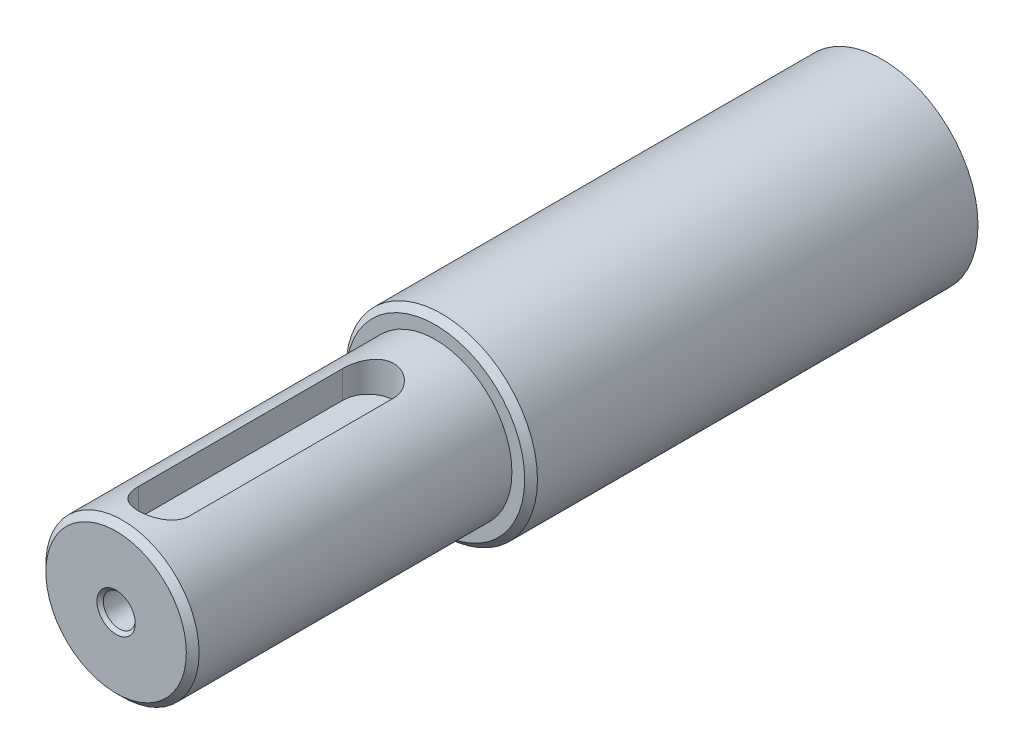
ISO-10303-21;
HEADER;
FILE_DESCRIPTION(('STEP AP214'),'2;1');
FILE_NAME('part.step','',(''),(''),'','','');
FILE_SCHEMA(('AUTOMOTIVE_DESIGN { 1 0 10303 214 1 1 1 1 }'));
ENDSEC;
DATA;
#1=APPLICATION_CONTEXT('core data for automotive mechanical design processes');
#2=APPLICATION_PROTOCOL_DEFINITION('international standard','automotive_design',2000,#1);
#3=PRODUCT_CONTEXT('',#1,'mechanical');
#4=PRODUCT('Part','Part','',(#3));
#5=PRODUCT_RELATED_PRODUCT_CATEGORY('part','',(#4));
#6=PRODUCT_DEFINITION_FORMATION('','',#4);
#7=PRODUCT_DEFINITION_CONTEXT('part definition',#1,'design');
#8=PRODUCT_DEFINITION('design','',#6,#7);
#9=PRODUCT_DEFINITION_SHAPE('','',#8);
#10=(LENGTH_UNIT() NAMED_UNIT(*) SI_UNIT(.MILLI.,.METRE.));
#11=(NAMED_UNIT(*) PLANE_ANGLE_UNIT() SI_UNIT($,.RADIAN.));
#12=(NAMED_UNIT(*) SI_UNIT($,.STERADIAN.) SOLID_ANGLE_UNIT());
#13=UNCERTAINTY_MEASURE_WITH_UNIT(LENGTH_MEASURE(1.E-05),#10,'distance_accuracy_value','');
#14=(GEOMETRIC_REPRESENTATION_CONTEXT(3) GLOBAL_UNCERTAINTY_ASSIGNED_CONTEXT((#13)) GLOBAL_UNIT_ASSIGNED_CONTEXT((#10,
#11,#12)) REPRESENTATION_CONTEXT('',''));
#15=CARTESIAN_POINT('',(0.,0.,0.));
#16=DIRECTION('',(0.,0.,1.));
#17=DIRECTION('',(1.,0.,0.));
#18=AXIS2_PLACEMENT_3D('',#15,#16,#17);
#19=CARTESIAN_POINT('',(0.,0.,120.));
#20=DIRECTION('',(0.,0.,-1.));
#21=DIRECTION('',(-1.,0.,0.));
#22=AXIS2_PLACEMENT_3D('',#19,#20,#21);
#23=CYLINDRICAL_SURFACE('',#22,12.);
#24=CARTESIAN_POINT('',(0.,0.,70.));
#25=DIRECTION('',(0.,0.,1.));
#26=DIRECTION('',(1.,0.,0.));
#27=AXIS2_PLACEMENT_3D('',#24,#25,#26);
#28=CIRCLE('',#27,12.);
#29=CARTESIAN_POINT('',(12.,0.,70.));
#30=VERTEX_POINT('',#29);
#31=EDGE_CURVE('E105',#30,#30,#28,.T.);
#32=ORIENTED_EDGE('',*,*,#31,.T.);
#33=EDGE_LOOP('',(#32));
#34=FACE_BOUND('',#33,.T.);
#35=CARTESIAN_POINT('',(0.,0.,119.));
#36=DIRECTION('',(0.,0.,1.));
#37=DIRECTION('',(1.,0.,0.));
#38=AXIS2_PLACEMENT_3D('',#35,#36,#37);
#39=CIRCLE('',#38,12.);
#40=CARTESIAN_POINT('',(12.,0.,119.));
#41=VERTEX_POINT('',#40);
#42=EDGE_CURVE('E114',#41,#41,#39,.F.);
#43=ORIENTED_EDGE('',*,*,#42,.T.);
#44=EDGE_LOOP('',(#43));
#45=FACE_BOUND('',#44,.T.);
#46=CARTESIAN_POINT('',(0.,12.,108.5));
#47=CARTESIAN_POINT('',(-0.218253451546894,12.0000006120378,108.499998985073));
#48=CARTESIAN_POINT('',(-0.436500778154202,11.9939907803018,108.517921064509));
#49=CARTESIAN_POINT('',(-0.866567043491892,11.9706084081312,108.588916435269));
#50=CARTESIAN_POINT('',(-1.07838531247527,11.9532346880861,108.641993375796));
#51=CARTESIAN_POINT('',(-1.48933115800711,11.9090123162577,108.781276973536));
#52=CARTESIAN_POINT('',(-1.68847930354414,11.8821795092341,108.867428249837));
#53=CARTESIAN_POINT('',(-2.0694997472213,11.8217778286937,109.070164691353));
#54=CARTESIAN_POINT('',(-2.25136862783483,11.7882076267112,109.18675586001));
#55=CARTESIAN_POINT('',(-2.59896670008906,11.7165637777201,109.451303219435));
#56=CARTESIAN_POINT('',(-2.76401480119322,11.6783822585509,109.600124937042));
#57=CARTESIAN_POINT('',(-3.06733077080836,11.6024125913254,109.923068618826));
#58=CARTESIAN_POINT('',(-3.20559274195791,11.5646245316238,110.097196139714));
#59=CARTESIAN_POINT('',(-3.45529976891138,11.4925332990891,110.471940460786));
#60=CARTESIAN_POINT('',(-3.5658594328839,11.4583615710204,110.673174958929));
#61=CARTESIAN_POINT('',(-3.75127549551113,11.3990122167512,111.092704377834));
#62=CARTESIAN_POINT('',(-3.82614278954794,11.3738318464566,111.310994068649));
#63=CARTESIAN_POINT('',(-3.93549384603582,11.3364521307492,111.750692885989));
#64=CARTESIAN_POINT('',(-3.97125379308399,11.3238438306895,111.971748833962));
#65=CARTESIAN_POINT('',(-4.005364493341,11.3118262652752,112.417055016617));
#66=CARTESIAN_POINT('',(-4.0037268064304,11.312412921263,112.641304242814));
#67=CARTESIAN_POINT('',(-3.96407961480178,11.3263605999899,113.075746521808));
#68=CARTESIAN_POINT('',(-3.92773565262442,11.3391366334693,113.286113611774));
#69=CARTESIAN_POINT('',(-3.82242465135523,11.3750663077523,113.697573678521));
#70=CARTESIAN_POINT('',(-3.75345370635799,11.3982211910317,113.898665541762));
#71=CARTESIAN_POINT('',(-3.58375623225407,11.4527164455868,114.289650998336));
#72=CARTESIAN_POINT('',(-3.4825361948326,11.4841826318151,114.47931210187));
#73=CARTESIAN_POINT('',(-3.251556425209,11.5517023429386,114.839483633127));
#74=CARTESIAN_POINT('',(-3.12178844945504,11.5877571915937,115.009988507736));
#75=CARTESIAN_POINT('',(-2.82939733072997,11.6626931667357,115.336366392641));
#76=CARTESIAN_POINT('',(-2.66541260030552,11.7016235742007,115.491010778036));
#77=CARTESIAN_POINT('',(-2.31335827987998,11.7762775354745,115.770925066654));
#78=CARTESIAN_POINT('',(-2.12528638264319,11.8120007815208,115.896192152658));
#79=CARTESIAN_POINT('',(-1.72779045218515,11.8766843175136,116.11478520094));
#80=CARTESIAN_POINT('',(-1.51817310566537,11.9055740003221,116.207781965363));
#81=CARTESIAN_POINT('',(-1.08507633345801,11.9528226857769,116.356812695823));
#82=CARTESIAN_POINT('',(-0.861601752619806,11.971185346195,116.412859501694));
#83=CARTESIAN_POINT('',(-0.417535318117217,11.9947050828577,116.484222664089));
#84=CARTESIAN_POINT('',(-0.197238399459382,12.0004000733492,116.501199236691));
#85=CARTESIAN_POINT('',(0.243100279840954,11.9995561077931,116.498669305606));
#86=CARTESIAN_POINT('',(0.463142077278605,11.9930192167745,116.479168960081));
#87=CARTESIAN_POINT('',(0.890079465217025,11.9688009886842,116.405552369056));
#88=CARTESIAN_POINT('',(1.09717122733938,11.9514479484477,116.352455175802));
#89=CARTESIAN_POINT('',(1.4994238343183,11.9076738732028,116.214426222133));
#90=CARTESIAN_POINT('',(1.69458315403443,11.881251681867,116.129490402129));
#91=CARTESIAN_POINT('',(2.0731531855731,11.8211572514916,115.927718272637));
#92=CARTESIAN_POINT('',(2.25611983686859,11.7873125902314,115.810101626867));
#93=CARTESIAN_POINT('',(2.60025932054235,11.7162101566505,115.547223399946));
#94=CARTESIAN_POINT('',(2.76142547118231,11.6789513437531,115.401953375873));
#95=CARTESIAN_POINT('',(3.0650100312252,11.6030739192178,115.080084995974));
#96=CARTESIAN_POINT('',(3.20624387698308,11.5644704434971,114.902363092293));
#97=CARTESIAN_POINT('',(3.4570300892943,11.4919989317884,114.524913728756));
#98=CARTESIAN_POINT('',(3.56658219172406,11.4581309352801,114.325186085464));
#99=CARTESIAN_POINT('',(3.75038772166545,11.3992956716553,113.90930793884));
#100=CARTESIAN_POINT('',(3.82471252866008,11.3743104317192,113.693191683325));
#101=CARTESIAN_POINT('',(3.93557866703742,11.336433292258,113.250485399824));
#102=CARTESIAN_POINT('',(3.97213701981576,11.3235359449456,113.023900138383));
#103=CARTESIAN_POINT('',(4.00510512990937,11.3119143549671,112.579211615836));
#104=CARTESIAN_POINT('',(4.0034810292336,11.3124960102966,112.361270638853));
#105=CARTESIAN_POINT('',(3.96496917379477,11.3260507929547,111.928939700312));
#106=CARTESIAN_POINT('',(3.92808351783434,11.3390231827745,111.71454952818));
#107=CARTESIAN_POINT('',(3.82148725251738,11.3753809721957,111.29945734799));
#108=CARTESIAN_POINT('',(3.75241338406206,11.3985639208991,111.098572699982));
#109=CARTESIAN_POINT('',(3.58391746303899,11.4526559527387,110.711090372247));
#110=CARTESIAN_POINT('',(3.48448867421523,11.4835667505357,110.524495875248));
#111=CARTESIAN_POINT('',(3.25304277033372,11.5513131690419,110.162065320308));
#112=CARTESIAN_POINT('',(3.11979297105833,11.5883484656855,109.987053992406));
#113=CARTESIAN_POINT('',(2.8265715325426,11.6633342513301,109.661240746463));
#114=CARTESIAN_POINT('',(2.66659233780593,11.7012849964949,109.510445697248));
#115=CARTESIAN_POINT('',(2.31696622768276,11.7756012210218,109.231422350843));
#116=CARTESIAN_POINT('',(2.12640605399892,11.8118472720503,109.104302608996));
#117=CARTESIAN_POINT('',(1.7254294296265,11.8770396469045,108.884038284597));
#118=CARTESIAN_POINT('',(1.51501807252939,11.9059878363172,108.790885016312));
#119=CARTESIAN_POINT('',(1.0899745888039,11.9522206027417,108.645113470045));
#120=CARTESIAN_POINT('',(0.87595103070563,11.9699684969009,108.590870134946));
#121=CARTESIAN_POINT('',(0.441281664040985,11.9938562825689,108.518318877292));
#122=CARTESIAN_POINT('',(0.220637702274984,11.9999993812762,108.500001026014));
#123=CARTESIAN_POINT('',(0.,12.,108.5));
#124=B_SPLINE_CURVE_WITH_KNOTS('',3,(#46,#47,#48,#49,#50,#51,#52,#53,#54,#55,#56,#57,#58,#59,
#60,#61,#62,#63,#64,#65,#66,#67,#68,#69,#70,#71,#72,#73,#74,#75,#76,#77,#78,#79,#80,#81,#82,#83,
#84,#85,#86,#87,#88,#89,#90,#91,#92,#93,#94,#95,#96,#97,#98,#99,#100,#101,#102,#103,#104,#105,
#106,#107,#108,#109,#110,#111,#112,#113,#114,#115,#116,#117,#118,#119,#120,#121,#122,#123),
.UNSPECIFIED.,.T.,.F.,(4,2,2,2,2,2,2,2,2,2,2,2,2,2,2,2,2,2,2,2,2,2,2,2,2,2,2,2,2,2,2,2,2,2,2,2,
2,2,4),(0.,0.653948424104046,1.30796474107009,1.9608906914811,2.6139455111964,3.28738737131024,
3.96097733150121,4.65393539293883,5.34668178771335,6.01607702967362,6.68526535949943,
7.32387306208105,7.96255723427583,8.61152684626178,9.26068410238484,9.94373223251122,
10.6268458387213,11.3167362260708,12.0063867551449,12.6661433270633,13.3257885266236,
13.9663263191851,14.6069458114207,15.264415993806,15.9220872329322,16.6096409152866,
17.2972003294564,17.9833605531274,18.6692113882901,19.3198266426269,19.9704031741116,
20.6086234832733,21.2469855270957,21.9132026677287,22.5796084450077,23.2719864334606,
23.9641872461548,24.6254623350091,25.2865546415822),.UNSPECIFIED.);
#125=CARTESIAN_POINT('',(-4.,11.3137084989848,112.5));
#126=VERTEX_POINT('',#125);
#127=CARTESIAN_POINT('',(4.,11.3137084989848,112.5));
#128=VERTEX_POINT('',#127);
#129=EDGE_CURVE('E55',#126,#128,#124,.T.);
#130=ORIENTED_EDGE('',*,*,#129,.F.);
#131=DIRECTION('',(0.,0.,-1.));
#132=VECTOR('',#131,1.);
#133=CARTESIAN_POINT('',(-4.,11.3137084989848,120.));
#134=LINE('',#133,#132);
#135=CARTESIAN_POINT('',(-4.,11.3137084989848,80.5));
#136=VERTEX_POINT('',#135);
#137=EDGE_CURVE('E123',#136,#126,#134,.F.);
#138=ORIENTED_EDGE('',*,*,#137,.F.);
#139=CARTESIAN_POINT('',(0.,12.,76.5));
#140=CARTESIAN_POINT('',(-0.218253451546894,12.0000006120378,76.4999989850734));
#141=CARTESIAN_POINT('',(-0.436500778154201,11.9939907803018,76.5179210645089));
#142=CARTESIAN_POINT('',(-0.866567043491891,11.9706084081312,76.5889164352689));
#143=CARTESIAN_POINT('',(-1.07838531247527,11.9532346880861,76.6419933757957));
#144=CARTESIAN_POINT('',(-1.4893311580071,11.9090123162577,76.7812769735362));
#145=CARTESIAN_POINT('',(-1.68847930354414,11.8821795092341,76.8674282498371));
#146=CARTESIAN_POINT('',(-2.0694997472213,11.8217778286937,77.0701646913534));
#147=CARTESIAN_POINT('',(-2.25136862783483,11.7882076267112,77.1867558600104));
#148=CARTESIAN_POINT('',(-2.59896670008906,11.7165637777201,77.451303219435));
#149=CARTESIAN_POINT('',(-2.76401480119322,11.6783822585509,77.600124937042));
#150=CARTESIAN_POINT('',(-3.06733077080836,11.6024125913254,77.9230686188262));
#151=CARTESIAN_POINT('',(-3.20559274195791,11.5646245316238,78.0971961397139));
#152=CARTESIAN_POINT('',(-3.45529976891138,11.4925332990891,78.471940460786));
#153=CARTESIAN_POINT('',(-3.5658594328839,11.4583615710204,78.673174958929));
#154=CARTESIAN_POINT('',(-3.75127549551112,11.3990122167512,79.0927043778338));
#155=CARTESIAN_POINT('',(-3.82614278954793,11.3738318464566,79.3109940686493));
#156=CARTESIAN_POINT('',(-3.93549384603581,11.3364521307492,79.7506928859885));
#157=CARTESIAN_POINT('',(-3.97125379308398,11.3238438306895,79.9717488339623));
#158=CARTESIAN_POINT('',(-4.005364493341,11.3118262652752,80.4170550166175));
#159=CARTESIAN_POINT('',(-4.0037268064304,11.312412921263,80.6413042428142));
#160=CARTESIAN_POINT('',(-3.96407961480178,11.3263605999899,81.0757465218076));
#161=CARTESIAN_POINT('',(-3.92773565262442,11.3391366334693,81.2861136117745));
#162=CARTESIAN_POINT('',(-3.82242465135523,11.3750663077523,81.6975736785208));
#163=CARTESIAN_POINT('',(-3.75345370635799,11.3982211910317,81.898665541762));
#164=CARTESIAN_POINT('',(-3.58375623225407,11.4527164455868,82.2896509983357));
#165=CARTESIAN_POINT('',(-3.4825361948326,11.4841826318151,82.47931210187));
#166=CARTESIAN_POINT('',(-3.25155642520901,11.5517023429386,82.839483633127));
#167=CARTESIAN_POINT('',(-3.12178844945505,11.5877571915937,83.0099885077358));
#168=CARTESIAN_POINT('',(-2.82939733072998,11.6626931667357,83.3363663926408));
#169=CARTESIAN_POINT('',(-2.66541260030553,11.7016235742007,83.4910107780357));
#170=CARTESIAN_POINT('',(-2.31335827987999,11.7762775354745,83.7709250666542));
#171=CARTESIAN_POINT('',(-2.12528638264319,11.8120007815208,83.8961921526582));
#172=CARTESIAN_POINT('',(-1.72779045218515,11.8766843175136,84.1147852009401));
#173=CARTESIAN_POINT('',(-1.51817310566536,11.9055740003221,84.2077819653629));
#174=CARTESIAN_POINT('',(-1.08507633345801,11.9528226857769,84.3568126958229));
#175=CARTESIAN_POINT('',(-0.861601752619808,11.971185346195,84.4128595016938));
#176=CARTESIAN_POINT('',(-0.417535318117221,11.9947050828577,84.4842226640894));
#177=CARTESIAN_POINT('',(-0.197238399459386,12.0004000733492,84.501199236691));
#178=CARTESIAN_POINT('',(0.243100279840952,11.9995561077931,84.4986693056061));
#179=CARTESIAN_POINT('',(0.463142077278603,11.9930192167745,84.4791689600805));
#180=CARTESIAN_POINT('',(0.890079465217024,11.9688009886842,84.4055523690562));
#181=CARTESIAN_POINT('',(1.09717122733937,11.9514479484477,84.352455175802));
#182=CARTESIAN_POINT('',(1.4994238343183,11.9076738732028,84.2144262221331));
#183=CARTESIAN_POINT('',(1.69458315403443,11.881251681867,84.1294904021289));
#184=CARTESIAN_POINT('',(2.0731531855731,11.8211572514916,83.9277182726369));
#185=CARTESIAN_POINT('',(2.25611983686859,11.7873125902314,83.8101016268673));
#186=CARTESIAN_POINT('',(2.60025932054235,11.7162101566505,83.5472233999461));
#187=CARTESIAN_POINT('',(2.76142547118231,11.6789513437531,83.4019533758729));
#188=CARTESIAN_POINT('',(3.0650100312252,11.6030739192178,83.0800849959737));
#189=CARTESIAN_POINT('',(3.20624387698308,11.5644704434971,82.9023630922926));
#190=CARTESIAN_POINT('',(3.4570300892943,11.4919989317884,82.5249137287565));
#191=CARTESIAN_POINT('',(3.56658219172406,11.4581309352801,82.3251860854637));
#192=CARTESIAN_POINT('',(3.75038772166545,11.3992956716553,81.9093079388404));
#193=CARTESIAN_POINT('',(3.82471252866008,11.3743104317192,81.693191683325));
#194=CARTESIAN_POINT('',(3.93557866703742,11.336433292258,81.2504853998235));
#195=CARTESIAN_POINT('',(3.97213701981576,11.3235359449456,81.0239001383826));
#196=CARTESIAN_POINT('',(4.00510512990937,11.3119143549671,80.5792116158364));
#197=CARTESIAN_POINT('',(4.0034810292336,11.3124960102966,80.3612706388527));
#198=CARTESIAN_POINT('',(3.96496917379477,11.3260507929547,79.9289397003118));
#199=CARTESIAN_POINT('',(3.92808351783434,11.3390231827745,79.7145495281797));
#200=CARTESIAN_POINT('',(3.82148725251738,11.3753809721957,79.2994573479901));
#201=CARTESIAN_POINT('',(3.75241338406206,11.3985639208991,79.098572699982));
#202=CARTESIAN_POINT('',(3.58391746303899,11.4526559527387,78.7110903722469));
#203=CARTESIAN_POINT('',(3.48448867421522,11.4835667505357,78.524495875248));
#204=CARTESIAN_POINT('',(3.25304277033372,11.5513131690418,78.1620653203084));
#205=CARTESIAN_POINT('',(3.11979297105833,11.5883484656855,77.9870539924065));
#206=CARTESIAN_POINT('',(2.8265715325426,11.6633342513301,77.6612407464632));
#207=CARTESIAN_POINT('',(2.66659233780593,11.7012849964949,77.5104456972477));
#208=CARTESIAN_POINT('',(2.31696622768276,11.7756012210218,77.2314223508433));
#209=CARTESIAN_POINT('',(2.12640605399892,11.8118472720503,77.104302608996));
#210=CARTESIAN_POINT('',(1.7254294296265,11.8770396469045,76.8840382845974));
#211=CARTESIAN_POINT('',(1.51501807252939,11.9059878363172,76.7908850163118));
#212=CARTESIAN_POINT('',(1.0899745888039,11.9522206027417,76.6451134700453));
#213=CARTESIAN_POINT('',(0.875951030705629,11.9699684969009,76.5908701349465));
#214=CARTESIAN_POINT('',(0.441281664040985,11.9938562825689,76.5183188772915));
#215=CARTESIAN_POINT('',(0.220637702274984,11.9999993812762,76.5000010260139));
#216=CARTESIAN_POINT('',(0.,12.,76.5));
#217=B_SPLINE_CURVE_WITH_KNOTS('',3,(#139,#140,#141,#142,#143,#144,#145,#146,#147,#148,#149,
#150,#151,#152,#153,#154,#155,#156,#157,#158,#159,#160,#161,#162,#163,#164,#165,#166,#167,#168,
#169,#170,#171,#172,#173,#174,#175,#176,#177,#178,#179,#180,#181,#182,#183,#184,#185,#186,#187,
#188,#189,#190,#191,#192,#193,#194,#195,#196,#197,#198,#199,#200,#201,#202,#203,#204,#205,#206,
#207,#208,#209,#210,#211,#212,#213,#214,#215,#216),.UNSPECIFIED.,.T.,.F.,(4,2,2,2,2,2,2,2,2,2,2,
2,2,2,2,2,2,2,2,2,2,2,2,2,2,2,2,2,2,2,2,2,2,2,2,2,2,2,4),(0.,0.653948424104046,1.30796474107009,
1.9608906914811,2.6139455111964,3.28738737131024,3.96097733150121,4.65393539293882,
5.34668178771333,6.01607702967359,6.68526535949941,7.32387306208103,7.96255723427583,
8.61152684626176,9.26068410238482,9.94373223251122,10.6268458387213,11.3167362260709,
12.0063867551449,12.6661433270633,13.3257885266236,13.9663263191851,14.6069458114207,
15.264415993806,15.9220872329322,16.6096409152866,17.2972003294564,17.9833605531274,
18.6692113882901,19.3198266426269,19.9704031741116,20.6086234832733,21.2469855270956,
21.9132026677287,22.5796084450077,23.2719864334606,23.9641872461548,24.6254623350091,
25.2865546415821),.UNSPECIFIED.);
#218=CARTESIAN_POINT('',(4.,11.3137084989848,80.5));
#219=VERTEX_POINT('',#218);
#220=EDGE_CURVE('E125',#219,#136,#217,.T.);
#221=ORIENTED_EDGE('',*,*,#220,.F.);
#222=DIRECTION('',(0.,0.,-1.));
#223=VECTOR('',#222,1.);
#224=CARTESIAN_POINT('',(4.,11.3137084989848,120.));
#225=LINE('',#224,#223);
#226=EDGE_CURVE('E131',#128,#219,#225,.T.);
#227=ORIENTED_EDGE('',*,*,#226,.F.);
#228=EDGE_LOOP('',(#130,#138,#221,#227));
#229=FACE_BOUND('',#228,.T.);
#230=ADVANCED_FACE('F32',(#34,#45,#229),#23,.T.);
#231=CARTESIAN_POINT('',(0.,0.,70.));
#232=DIRECTION('',(0.,0.,1.));
#233=DIRECTION('',(1.,0.,0.));
#234=AXIS2_PLACEMENT_3D('',#231,#232,#233);
#235=PLANE('',#234);
#236=CARTESIAN_POINT('',(0.,0.,70.));
#237=DIRECTION('',(0.,0.,1.));
#238=DIRECTION('',(1.,0.,0.));
#239=AXIS2_PLACEMENT_3D('',#236,#237,#238);
#240=CIRCLE('',#239,14.);
#241=CARTESIAN_POINT('',(14.,0.,70.));
#242=VERTEX_POINT('',#241);
#243=EDGE_CURVE('E117',#242,#242,#240,.T.);
#244=ORIENTED_EDGE('',*,*,#243,.T.);
#245=EDGE_LOOP('',(#244));
#246=FACE_BOUND('',#245,.T.);
#247=ORIENTED_EDGE('',*,*,#31,.F.);
#248=EDGE_LOOP('',(#247));
#249=FACE_BOUND('',#248,.T.);
#250=ADVANCED_FACE('F165',(#246,#249),#235,.T.);
#251=CARTESIAN_POINT('',(0.,0.,70.));
#252=DIRECTION('',(0.,0.,-1.));
#253=DIRECTION('',(-1.,0.,0.));
#254=AXIS2_PLACEMENT_3D('',#251,#252,#253);
#255=CYLINDRICAL_SURFACE('',#254,15.);
#256=CARTESIAN_POINT('',(0.,0.,69.));
#257=DIRECTION('',(0.,0.,1.));
#258=DIRECTION('',(1.,0.,0.));
#259=AXIS2_PLACEMENT_3D('',#256,#257,#258);
#260=CIRCLE('',#259,15.);
#261=CARTESIAN_POINT('',(15.,0.,69.));
#262=VERTEX_POINT('',#261);
#263=EDGE_CURVE('E120',#262,#262,#260,.F.);
#264=ORIENTED_EDGE('',*,*,#263,.T.);
#265=EDGE_LOOP('',(#264));
#266=FACE_BOUND('',#265,.T.);
#267=CARTESIAN_POINT('',(0.,0.,0.));
#268=DIRECTION('',(0.,0.,1.));
#269=DIRECTION('',(1.,0.,0.));
#270=AXIS2_PLACEMENT_3D('',#267,#268,#269);
#271=CIRCLE('',#270,15.);
#272=CARTESIAN_POINT('',(15.,0.,0.));
#273=VERTEX_POINT('',#272);
#274=EDGE_CURVE('E108',#273,#273,#271,.T.);
#275=ORIENTED_EDGE('',*,*,#274,.T.);
#276=EDGE_LOOP('',(#275));
#277=FACE_BOUND('',#276,.T.);
#278=ADVANCED_FACE('F170',(#266,#277),#255,.T.);
#279=CARTESIAN_POINT('',(0.,0.,0.));
#280=DIRECTION('',(0.,0.,1.));
#281=DIRECTION('',(1.,0.,0.));
#282=AXIS2_PLACEMENT_3D('',#279,#280,#281);
#283=PLANE('',#282);
#284=ORIENTED_EDGE('',*,*,#274,.F.);
#285=EDGE_LOOP('',(#284));
#286=FACE_BOUND('',#285,.T.);
#287=ADVANCED_FACE('F212',(#286),#283,.F.);
#288=CARTESIAN_POINT('',(0.,0.,120.));
#289=DIRECTION('',(0.,0.,1.));
#290=DIRECTION('',(1.,0.,0.));
#291=AXIS2_PLACEMENT_3D('',#288,#289,#290);
#292=PLANE('',#291);
#293=CARTESIAN_POINT('',(0.,0.,120.));
#294=DIRECTION('',(0.,0.,1.));
#295=DIRECTION('',(1.,0.,0.));
#296=AXIS2_PLACEMENT_3D('',#293,#294,#295);
#297=CIRCLE('',#296,2.99999999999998);
#298=CARTESIAN_POINT('',(2.99999999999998,0.,120.));
#299=VERTEX_POINT('',#298);
#300=EDGE_CURVE('E11',#299,#299,#297,.F.);
#301=ORIENTED_EDGE('',*,*,#300,.T.);
#302=EDGE_LOOP('',(#301));
#303=FACE_BOUND('',#302,.T.);
#304=CARTESIAN_POINT('',(0.,0.,120.));
#305=DIRECTION('',(0.,0.,1.));
#306=DIRECTION('',(1.,0.,0.));
#307=AXIS2_PLACEMENT_3D('',#304,#305,#306);
#308=CIRCLE('',#307,11.);
#309=CARTESIAN_POINT('',(11.,0.,120.));
#310=VERTEX_POINT('',#309);
#311=EDGE_CURVE('E111',#310,#310,#308,.T.);
#312=ORIENTED_EDGE('',*,*,#311,.T.);
#313=EDGE_LOOP('',(#312));
#314=FACE_BOUND('',#313,.T.);
#315=ADVANCED_FACE('F152',(#303,#314),#292,.T.);
#316=CARTESIAN_POINT('',(0.,0.,120.));
#317=DIRECTION('',(0.,0.,-1.));
#318=DIRECTION('',(-1.,0.,0.));
#319=AXIS2_PLACEMENT_3D('',#316,#317,#318);
#320=CONICAL_SURFACE('',#319,11.,0.785398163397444);
#321=ORIENTED_EDGE('',*,*,#42,.F.);
#322=EDGE_LOOP('',(#321));
#323=FACE_BOUND('',#322,.T.);
#324=ORIENTED_EDGE('',*,*,#311,.F.);
#325=EDGE_LOOP('',(#324));
#326=FACE_BOUND('',#325,.T.);
#327=ADVANCED_FACE('F211',(#323,#326),#320,.T.);
#328=CARTESIAN_POINT('',(0.,0.,70.));
#329=DIRECTION('',(0.,0.,-1.));
#330=DIRECTION('',(-1.,0.,0.));
#331=AXIS2_PLACEMENT_3D('',#328,#329,#330);
#332=CONICAL_SURFACE('',#331,14.,0.785398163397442);
#333=ORIENTED_EDGE('',*,*,#263,.F.);
#334=EDGE_LOOP('',(#333));
#335=FACE_BOUND('',#334,.T.);
#336=ORIENTED_EDGE('',*,*,#243,.F.);
#337=EDGE_LOOP('',(#336));
#338=FACE_BOUND('',#337,.T.);
#339=ADVANCED_FACE('F151',(#335,#338),#332,.T.);
#340=CARTESIAN_POINT('',(0.,15.,112.5));
#341=DIRECTION('',(0.,-1.,0.));
#342=DIRECTION('',(0.,0.,-1.));
#343=AXIS2_PLACEMENT_3D('',#340,#341,#342);
#344=CYLINDRICAL_SURFACE('',#343,4.);
#345=ORIENTED_EDGE('',*,*,#129,.T.);
#346=DIRECTION('',(0.,-1.,0.));
#347=VECTOR('',#346,1.);
#348=CARTESIAN_POINT('',(4.,15.,112.5));
#349=LINE('',#348,#347);
#350=CARTESIAN_POINT('',(4.,7.,112.5));
#351=VERTEX_POINT('',#350);
#352=EDGE_CURVE('E103',#128,#351,#349,.T.);
#353=ORIENTED_EDGE('',*,*,#352,.T.);
#354=CARTESIAN_POINT('',(0.,7.,112.5));
#355=DIRECTION('',(0.,1.,0.));
#356=DIRECTION('',(0.,0.,1.));
#357=AXIS2_PLACEMENT_3D('',#354,#355,#356);
#358=CIRCLE('',#357,4.);
#359=CARTESIAN_POINT('',(-4.,7.,112.5));
#360=VERTEX_POINT('',#359);
#361=EDGE_CURVE('E84',#360,#351,#358,.T.);
#362=ORIENTED_EDGE('',*,*,#361,.F.);
#363=DIRECTION('',(0.,-1.,0.));
#364=VECTOR('',#363,1.);
#365=CARTESIAN_POINT('',(-4.,15.,112.5));
#366=LINE('',#365,#364);
#367=EDGE_CURVE('E98',#126,#360,#366,.T.);
#368=ORIENTED_EDGE('',*,*,#367,.F.);
#369=EDGE_LOOP('',(#345,#353,#362,#368));
#370=FACE_BOUND('',#369,.T.);
#371=ADVANCED_FACE('F147',(#370),#344,.F.);
#372=CARTESIAN_POINT('',(4.,15.,80.5));
#373=DIRECTION('',(-1.,0.,0.));
#374=DIRECTION('',(0.,0.,1.));
#375=AXIS2_PLACEMENT_3D('',#372,#373,#374);
#376=PLANE('',#375);
#377=ORIENTED_EDGE('',*,*,#226,.T.);
#378=DIRECTION('',(0.,-1.,0.));
#379=VECTOR('',#378,1.);
#380=CARTESIAN_POINT('',(4.,15.,80.5));
#381=LINE('',#380,#379);
#382=CARTESIAN_POINT('',(4.,7.,80.5));
#383=VERTEX_POINT('',#382);
#384=EDGE_CURVE('E101',#219,#383,#381,.T.);
#385=ORIENTED_EDGE('',*,*,#384,.T.);
#386=DIRECTION('',(0.,0.,-1.));
#387=VECTOR('',#386,1.);
#388=CARTESIAN_POINT('',(4.,7.,80.5));
#389=LINE('',#388,#387);
#390=EDGE_CURVE('E87',#351,#383,#389,.T.);
#391=ORIENTED_EDGE('',*,*,#390,.F.);
#392=ORIENTED_EDGE('',*,*,#352,.F.);
#393=EDGE_LOOP('',(#377,#385,#391,#392));
#394=FACE_BOUND('',#393,.T.);
#395=ADVANCED_FACE('F142',(#394),#376,.T.);
#396=CARTESIAN_POINT('',(0.,15.,80.5));
#397=DIRECTION('',(0.,-1.,0.));
#398=DIRECTION('',(0.,0.,-1.));
#399=AXIS2_PLACEMENT_3D('',#396,#397,#398);
#400=CYLINDRICAL_SURFACE('',#399,4.);
#401=ORIENTED_EDGE('',*,*,#220,.T.);
#402=DIRECTION('',(0.,-1.,0.));
#403=VECTOR('',#402,1.);
#404=CARTESIAN_POINT('',(-4.,15.,80.5));
#405=LINE('',#404,#403);
#406=CARTESIAN_POINT('',(-4.,7.,80.5));
#407=VERTEX_POINT('',#406);
#408=EDGE_CURVE('E47',#136,#407,#405,.T.);
#409=ORIENTED_EDGE('',*,*,#408,.T.);
#410=CARTESIAN_POINT('',(0.,7.,80.5));
#411=DIRECTION('',(0.,1.,0.));
#412=DIRECTION('',(0.,0.,1.));
#413=AXIS2_PLACEMENT_3D('',#410,#411,#412);
#414=CIRCLE('',#413,4.);
#415=EDGE_CURVE('E92',#383,#407,#414,.T.);
#416=ORIENTED_EDGE('',*,*,#415,.F.);
#417=ORIENTED_EDGE('',*,*,#384,.F.);
#418=EDGE_LOOP('',(#401,#409,#416,#417));
#419=FACE_BOUND('',#418,.T.);
#420=ADVANCED_FACE('F136',(#419),#400,.F.);
#421=CARTESIAN_POINT('',(-4.,15.,112.5));
#422=DIRECTION('',(1.,0.,0.));
#423=DIRECTION('',(0.,0.,-1.));
#424=AXIS2_PLACEMENT_3D('',#421,#422,#423);
#425=PLANE('',#424);
#426=ORIENTED_EDGE('',*,*,#137,.T.);
#427=ORIENTED_EDGE('',*,*,#367,.T.);
#428=DIRECTION('',(0.,0.,1.));
#429=VECTOR('',#428,1.);
#430=CARTESIAN_POINT('',(-4.,7.,112.5));
#431=LINE('',#430,#429);
#432=EDGE_CURVE('E95',#407,#360,#431,.T.);
#433=ORIENTED_EDGE('',*,*,#432,.F.);
#434=ORIENTED_EDGE('',*,*,#408,.F.);
#435=EDGE_LOOP('',(#426,#427,#433,#434));
#436=FACE_BOUND('',#435,.T.);
#437=ADVANCED_FACE('F141',(#436),#425,.T.);
#438=CARTESIAN_POINT('',(0.,7.,112.5));
#439=DIRECTION('',(0.,1.,0.));
#440=DIRECTION('',(0.,0.,1.));
#441=AXIS2_PLACEMENT_3D('',#438,#439,#440);
#442=PLANE('',#441);
#443=ORIENTED_EDGE('',*,*,#361,.T.);
#444=ORIENTED_EDGE('',*,*,#390,.T.);
#445=ORIENTED_EDGE('',*,*,#415,.T.);
#446=ORIENTED_EDGE('',*,*,#432,.T.);
#447=EDGE_LOOP('',(#443,#444,#445,#446));
#448=FACE_BOUND('',#447,.T.);
#449=ADVANCED_FACE('F183',(#448),#442,.T.);
#450=CARTESIAN_POINT('',(0.,0.,120.));
#451=DIRECTION('',(0.,0.,1.));
#452=DIRECTION('',(1.,0.,0.));
#453=AXIS2_PLACEMENT_3D('',#450,#451,#452);
#454=CYLINDRICAL_SURFACE('',#453,2.5);
#455=CARTESIAN_POINT('',(0.,0.,119.5));
#456=DIRECTION('',(0.,0.,1.));
#457=DIRECTION('',(1.,0.,0.));
#458=AXIS2_PLACEMENT_3D('',#455,#456,#457);
#459=CIRCLE('',#458,2.5);
#460=CARTESIAN_POINT('',(2.5,0.,119.5));
#461=VERTEX_POINT('',#460);
#462=EDGE_CURVE('E40',#461,#461,#459,.T.);
#463=ORIENTED_EDGE('',*,*,#462,.T.);
#464=EDGE_LOOP('',(#463));
#465=FACE_BOUND('',#464,.T.);
#466=CARTESIAN_POINT('',(0.,0.,103.));
#467=DIRECTION('',(0.,0.,1.));
#468=DIRECTION('',(1.,0.,0.));
#469=AXIS2_PLACEMENT_3D('',#466,#467,#468);
#470=CIRCLE('',#469,2.5);
#471=CARTESIAN_POINT('',(2.5,0.,103.));
#472=VERTEX_POINT('',#471);
#473=EDGE_CURVE('E82',#472,#472,#470,.T.);
#474=ORIENTED_EDGE('',*,*,#473,.F.);
#475=EDGE_LOOP('',(#474));
#476=FACE_BOUND('',#475,.T.);
#477=ADVANCED_FACE('F78',(#465,#476),#454,.F.);
#478=CARTESIAN_POINT('',(0.,0.,103.));
#479=DIRECTION('',(0.,0.,1.));
#480=DIRECTION('',(1.,0.,0.));
#481=AXIS2_PLACEMENT_3D('',#478,#479,#480);
#482=CONICAL_SURFACE('',#481,2.5,1.02974425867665);
#483=CARTESIAN_POINT('',(0.,0.,101.497848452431));
#484=VERTEX_POINT('',#483);
#485=VERTEX_LOOP('',#484);
#486=FACE_BOUND('',#485,.T.);
#487=ORIENTED_EDGE('',*,*,#473,.T.);
#488=EDGE_LOOP('',(#487));
#489=FACE_BOUND('',#488,.T.);
#490=ADVANCED_FACE('F75',(#486,#489),#482,.F.);
#491=CARTESIAN_POINT('',(0.,0.,119.5));
#492=DIRECTION('',(0.,0.,1.));
#493=DIRECTION('',(1.,0.,0.));
#494=AXIS2_PLACEMENT_3D('',#491,#492,#493);
#495=CONICAL_SURFACE('',#494,2.5,0.785398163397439);
#496=ORIENTED_EDGE('',*,*,#300,.F.);
#497=EDGE_LOOP('',(#496));
#498=FACE_BOUND('',#497,.T.);
#499=ORIENTED_EDGE('',*,*,#462,.F.);
#500=EDGE_LOOP('',(#499));
#501=FACE_BOUND('',#500,.T.);
#502=ADVANCED_FACE('F34',(#498,#501),#495,.F.);
#503=CLOSED_SHELL('',(#230,#250,#278,#287,#315,#327,#339,#371,#395,#420,#437,#449,#477,#490,#502));
#504=MANIFOLD_SOLID_BREP('B2',#503);
#505=ADVANCED_BREP_SHAPE_REPRESENTATION('',(#18,#504),#14);
#506=SHAPE_DEFINITION_REPRESENTATION(#9,#505);
ENDSEC;
END-ISO-10303-21;
